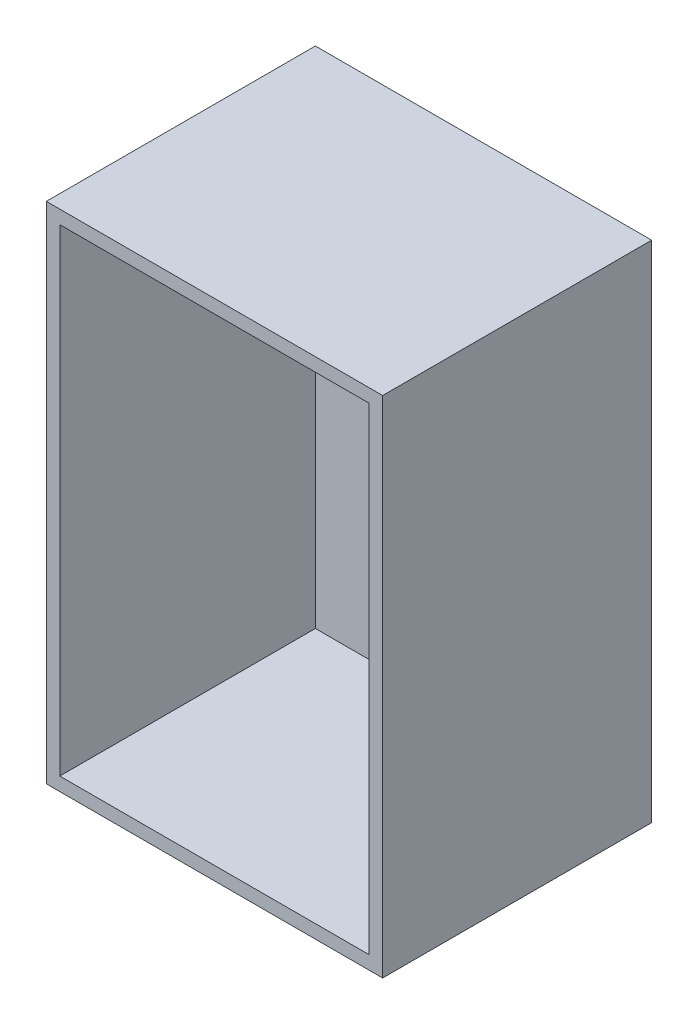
ISO-10303-21;
HEADER;
FILE_DESCRIPTION(('STEP AP214'),'2;1');
FILE_NAME('part.step','',(''),(''),'','','');
FILE_SCHEMA(('AUTOMOTIVE_DESIGN { 1 0 10303 214 1 1 1 1 }'));
ENDSEC;
DATA;
#1=APPLICATION_CONTEXT('core data for automotive mechanical design processes');
#2=APPLICATION_PROTOCOL_DEFINITION('international standard','automotive_design',2000,#1);
#3=PRODUCT_CONTEXT('',#1,'mechanical');
#4=PRODUCT('Part','Part','',(#3));
#5=PRODUCT_RELATED_PRODUCT_CATEGORY('part','',(#4));
#6=PRODUCT_DEFINITION_FORMATION('','',#4);
#7=PRODUCT_DEFINITION_CONTEXT('part definition',#1,'design');
#8=PRODUCT_DEFINITION('design','',#6,#7);
#9=PRODUCT_DEFINITION_SHAPE('','',#8);
#10=(LENGTH_UNIT() NAMED_UNIT(*) SI_UNIT(.MILLI.,.METRE.));
#11=(NAMED_UNIT(*) PLANE_ANGLE_UNIT() SI_UNIT($,.RADIAN.));
#12=(NAMED_UNIT(*) SI_UNIT($,.STERADIAN.) SOLID_ANGLE_UNIT());
#13=UNCERTAINTY_MEASURE_WITH_UNIT(LENGTH_MEASURE(1.E-05),#10,'distance_accuracy_value','');
#14=(GEOMETRIC_REPRESENTATION_CONTEXT(3) GLOBAL_UNCERTAINTY_ASSIGNED_CONTEXT((#13)) GLOBAL_UNIT_ASSIGNED_CONTEXT((#10,
#11,#12)) REPRESENTATION_CONTEXT('',''));
#15=CARTESIAN_POINT('',(0.,0.,0.));
#16=DIRECTION('',(0.,0.,1.));
#17=DIRECTION('',(1.,0.,0.));
#18=AXIS2_PLACEMENT_3D('',#15,#16,#17);
#19=CARTESIAN_POINT('',(-50.,-75.,40.));
#20=DIRECTION('',(1.,0.,0.));
#21=DIRECTION('',(0.,0.,-1.));
#22=AXIS2_PLACEMENT_3D('',#19,#20,#21);
#23=PLANE('',#22);
#24=DIRECTION('',(0.,-1.,0.));
#25=VECTOR('',#24,1.);
#26=CARTESIAN_POINT('',(-50.,-75.,-40.));
#27=LINE('',#26,#25);
#28=CARTESIAN_POINT('',(-50.,75.,-40.));
#29=VERTEX_POINT('',#28);
#30=CARTESIAN_POINT('',(-50.,-75.,-40.));
#31=VERTEX_POINT('',#30);
#32=EDGE_CURVE('E146',#29,#31,#27,.T.);
#33=ORIENTED_EDGE('',*,*,#32,.T.);
#34=DIRECTION('',(0.,0.,-1.));
#35=VECTOR('',#34,1.);
#36=CARTESIAN_POINT('',(-50.,-75.,40.));
#37=LINE('',#36,#35);
#38=CARTESIAN_POINT('',(-50.,-75.,40.));
#39=VERTEX_POINT('',#38);
#40=EDGE_CURVE('E11',#39,#31,#37,.T.);
#41=ORIENTED_EDGE('',*,*,#40,.F.);
#42=DIRECTION('',(0.,-1.,0.));
#43=VECTOR('',#42,1.);
#44=CARTESIAN_POINT('',(-50.,-75.,40.));
#45=LINE('',#44,#43);
#46=CARTESIAN_POINT('',(-50.,75.,40.));
#47=VERTEX_POINT('',#46);
#48=EDGE_CURVE('E139',#47,#39,#45,.T.);
#49=ORIENTED_EDGE('',*,*,#48,.F.);
#50=DIRECTION('',(0.,0.,-1.));
#51=VECTOR('',#50,1.);
#52=CARTESIAN_POINT('',(-50.,75.,40.));
#53=LINE('',#52,#51);
#54=EDGE_CURVE('E145',#47,#29,#53,.T.);
#55=ORIENTED_EDGE('',*,*,#54,.T.);
#56=EDGE_LOOP('',(#33,#41,#49,#55));
#57=FACE_BOUND('',#56,.T.);
#58=ADVANCED_FACE('F32',(#57),#23,.F.);
#59=CARTESIAN_POINT('',(50.,-75.,40.));
#60=DIRECTION('',(0.,1.,0.));
#61=DIRECTION('',(-1.,0.,0.));
#62=AXIS2_PLACEMENT_3D('',#59,#60,#61);
#63=PLANE('',#62);
#64=DIRECTION('',(1.,0.,0.));
#65=VECTOR('',#64,1.);
#66=CARTESIAN_POINT('',(50.,-75.,-40.));
#67=LINE('',#66,#65);
#68=CARTESIAN_POINT('',(50.,-75.,-40.));
#69=VERTEX_POINT('',#68);
#70=EDGE_CURVE('E149',#31,#69,#67,.T.);
#71=ORIENTED_EDGE('',*,*,#70,.T.);
#72=DIRECTION('',(0.,0.,-1.));
#73=VECTOR('',#72,1.);
#74=CARTESIAN_POINT('',(50.,-75.,40.));
#75=LINE('',#74,#73);
#76=CARTESIAN_POINT('',(50.,-75.,40.));
#77=VERTEX_POINT('',#76);
#78=EDGE_CURVE('E39',#77,#69,#75,.T.);
#79=ORIENTED_EDGE('',*,*,#78,.F.);
#80=DIRECTION('',(1.,0.,0.));
#81=VECTOR('',#80,1.);
#82=CARTESIAN_POINT('',(50.,-75.,40.));
#83=LINE('',#82,#81);
#84=EDGE_CURVE('E83',#39,#77,#83,.T.);
#85=ORIENTED_EDGE('',*,*,#84,.F.);
#86=ORIENTED_EDGE('',*,*,#40,.T.);
#87=EDGE_LOOP('',(#71,#79,#85,#86));
#88=FACE_BOUND('',#87,.T.);
#89=ADVANCED_FACE('F178',(#88),#63,.F.);
#90=CARTESIAN_POINT('',(50.,-75.,40.));
#91=DIRECTION('',(-1.,0.,0.));
#92=DIRECTION('',(0.,0.,1.));
#93=AXIS2_PLACEMENT_3D('',#90,#91,#92);
#94=PLANE('',#93);
#95=DIRECTION('',(0.,1.,0.));
#96=VECTOR('',#95,1.);
#97=CARTESIAN_POINT('',(50.,-75.,-40.));
#98=LINE('',#97,#96);
#99=CARTESIAN_POINT('',(50.,75.,-40.));
#100=VERTEX_POINT('',#99);
#101=EDGE_CURVE('E151',#69,#100,#98,.T.);
#102=ORIENTED_EDGE('',*,*,#101,.T.);
#103=DIRECTION('',(0.,0.,-1.));
#104=VECTOR('',#103,1.);
#105=CARTESIAN_POINT('',(50.,75.,40.));
#106=LINE('',#105,#104);
#107=CARTESIAN_POINT('',(50.,75.,40.));
#108=VERTEX_POINT('',#107);
#109=EDGE_CURVE('E155',#108,#100,#106,.T.);
#110=ORIENTED_EDGE('',*,*,#109,.F.);
#111=DIRECTION('',(0.,1.,0.));
#112=VECTOR('',#111,1.);
#113=CARTESIAN_POINT('',(50.,-75.,40.));
#114=LINE('',#113,#112);
#115=EDGE_CURVE('E142',#77,#108,#114,.T.);
#116=ORIENTED_EDGE('',*,*,#115,.F.);
#117=ORIENTED_EDGE('',*,*,#78,.T.);
#118=EDGE_LOOP('',(#102,#110,#116,#117));
#119=FACE_BOUND('',#118,.T.);
#120=ADVANCED_FACE('F160',(#119),#94,.F.);
#121=CARTESIAN_POINT('',(50.,75.,40.));
#122=DIRECTION('',(0.,-1.,0.));
#123=DIRECTION('',(1.,0.,0.));
#124=AXIS2_PLACEMENT_3D('',#121,#122,#123);
#125=PLANE('',#124);
#126=DIRECTION('',(-1.,0.,0.));
#127=VECTOR('',#126,1.);
#128=CARTESIAN_POINT('',(50.,75.,-40.));
#129=LINE('',#128,#127);
#130=EDGE_CURVE('E76',#100,#29,#129,.T.);
#131=ORIENTED_EDGE('',*,*,#130,.T.);
#132=ORIENTED_EDGE('',*,*,#54,.F.);
#133=DIRECTION('',(-1.,0.,0.));
#134=VECTOR('',#133,1.);
#135=CARTESIAN_POINT('',(50.,75.,40.));
#136=LINE('',#135,#134);
#137=EDGE_CURVE('E55',#108,#47,#136,.T.);
#138=ORIENTED_EDGE('',*,*,#137,.F.);
#139=ORIENTED_EDGE('',*,*,#109,.T.);
#140=EDGE_LOOP('',(#131,#132,#138,#139));
#141=FACE_BOUND('',#140,.T.);
#142=ADVANCED_FACE('F168',(#141),#125,.F.);
#143=CARTESIAN_POINT('',(0.,0.,40.));
#144=DIRECTION('',(0.,0.,1.));
#145=DIRECTION('',(1.,0.,0.));
#146=AXIS2_PLACEMENT_3D('',#143,#144,#145);
#147=PLANE('',#146);
#148=DIRECTION('',(0.,-1.,0.));
#149=VECTOR('',#148,1.);
#150=CARTESIAN_POINT('',(-46.,-75.,40.));
#151=LINE('',#150,#149);
#152=CARTESIAN_POINT('',(-46.,71.,40.));
#153=VERTEX_POINT('',#152);
#154=CARTESIAN_POINT('',(-46.,-71.,40.));
#155=VERTEX_POINT('',#154);
#156=EDGE_CURVE('E128',#153,#155,#151,.T.);
#157=ORIENTED_EDGE('',*,*,#156,.F.);
#158=DIRECTION('',(-1.,0.,0.));
#159=VECTOR('',#158,1.);
#160=CARTESIAN_POINT('',(50.,71.,40.));
#161=LINE('',#160,#159);
#162=CARTESIAN_POINT('',(46.,71.,40.));
#163=VERTEX_POINT('',#162);
#164=EDGE_CURVE('E137',#163,#153,#161,.T.);
#165=ORIENTED_EDGE('',*,*,#164,.F.);
#166=DIRECTION('',(0.,1.,0.));
#167=VECTOR('',#166,1.);
#168=CARTESIAN_POINT('',(46.,-75.,40.));
#169=LINE('',#168,#167);
#170=CARTESIAN_POINT('',(46.,-71.,40.));
#171=VERTEX_POINT('',#170);
#172=EDGE_CURVE('E135',#171,#163,#169,.T.);
#173=ORIENTED_EDGE('',*,*,#172,.F.);
#174=DIRECTION('',(1.,0.,0.));
#175=VECTOR('',#174,1.);
#176=CARTESIAN_POINT('',(50.,-71.,40.));
#177=LINE('',#176,#175);
#178=EDGE_CURVE('E120',#155,#171,#177,.T.);
#179=ORIENTED_EDGE('',*,*,#178,.F.);
#180=EDGE_LOOP('',(#157,#165,#173,#179));
#181=FACE_BOUND('',#180,.T.);
#182=ORIENTED_EDGE('',*,*,#48,.T.);
#183=ORIENTED_EDGE('',*,*,#84,.T.);
#184=ORIENTED_EDGE('',*,*,#115,.T.);
#185=ORIENTED_EDGE('',*,*,#137,.T.);
#186=EDGE_LOOP('',(#182,#183,#184,#185));
#187=FACE_BOUND('',#186,.T.);
#188=ADVANCED_FACE('F170',(#181,#187),#147,.T.);
#189=CARTESIAN_POINT('',(0.,0.,-40.));
#190=DIRECTION('',(0.,0.,1.));
#191=DIRECTION('',(1.,0.,0.));
#192=AXIS2_PLACEMENT_3D('',#189,#190,#191);
#193=PLANE('',#192);
#194=ORIENTED_EDGE('',*,*,#32,.F.);
#195=ORIENTED_EDGE('',*,*,#130,.F.);
#196=ORIENTED_EDGE('',*,*,#101,.F.);
#197=ORIENTED_EDGE('',*,*,#70,.F.);
#198=EDGE_LOOP('',(#194,#195,#196,#197));
#199=FACE_BOUND('',#198,.T.);
#200=ADVANCED_FACE('F164',(#199),#193,.F.);
#201=CARTESIAN_POINT('',(-46.,-75.,40.));
#202=DIRECTION('',(1.,0.,0.));
#203=DIRECTION('',(0.,0.,-1.));
#204=AXIS2_PLACEMENT_3D('',#201,#202,#203);
#205=PLANE('',#204);
#206=DIRECTION('',(0.,-1.,0.));
#207=VECTOR('',#206,1.);
#208=CARTESIAN_POINT('',(-46.,-75.,-36.));
#209=LINE('',#208,#207);
#210=CARTESIAN_POINT('',(-46.,71.,-36.));
#211=VERTEX_POINT('',#210);
#212=CARTESIAN_POINT('',(-46.,-71.,-36.));
#213=VERTEX_POINT('',#212);
#214=EDGE_CURVE('E111',#211,#213,#209,.T.);
#215=ORIENTED_EDGE('',*,*,#214,.F.);
#216=DIRECTION('',(0.,0.,-1.));
#217=VECTOR('',#216,1.);
#218=CARTESIAN_POINT('',(-46.,71.,40.));
#219=LINE('',#218,#217);
#220=EDGE_CURVE('E131',#153,#211,#219,.T.);
#221=ORIENTED_EDGE('',*,*,#220,.F.);
#222=ORIENTED_EDGE('',*,*,#156,.T.);
#223=DIRECTION('',(0.,0.,-1.));
#224=VECTOR('',#223,1.);
#225=CARTESIAN_POINT('',(-46.,-71.,40.));
#226=LINE('',#225,#224);
#227=EDGE_CURVE('E123',#155,#213,#226,.T.);
#228=ORIENTED_EDGE('',*,*,#227,.T.);
#229=EDGE_LOOP('',(#215,#221,#222,#228));
#230=FACE_BOUND('',#229,.T.);
#231=ADVANCED_FACE('F205',(#230),#205,.T.);
#232=CARTESIAN_POINT('',(50.,-71.,40.));
#233=DIRECTION('',(0.,1.,0.));
#234=DIRECTION('',(-1.,0.,0.));
#235=AXIS2_PLACEMENT_3D('',#232,#233,#234);
#236=PLANE('',#235);
#237=DIRECTION('',(1.,0.,0.));
#238=VECTOR('',#237,1.);
#239=CARTESIAN_POINT('',(50.,-71.,-36.));
#240=LINE('',#239,#238);
#241=CARTESIAN_POINT('',(46.,-71.,-36.));
#242=VERTEX_POINT('',#241);
#243=EDGE_CURVE('E105',#213,#242,#240,.T.);
#244=ORIENTED_EDGE('',*,*,#243,.F.);
#245=ORIENTED_EDGE('',*,*,#227,.F.);
#246=ORIENTED_EDGE('',*,*,#178,.T.);
#247=DIRECTION('',(0.,0.,-1.));
#248=VECTOR('',#247,1.);
#249=CARTESIAN_POINT('',(46.,-71.,40.));
#250=LINE('',#249,#248);
#251=EDGE_CURVE('E117',#171,#242,#250,.T.);
#252=ORIENTED_EDGE('',*,*,#251,.T.);
#253=EDGE_LOOP('',(#244,#245,#246,#252));
#254=FACE_BOUND('',#253,.T.);
#255=ADVANCED_FACE('F118',(#254),#236,.T.);
#256=CARTESIAN_POINT('',(46.,-75.,40.));
#257=DIRECTION('',(-1.,0.,0.));
#258=DIRECTION('',(0.,0.,1.));
#259=AXIS2_PLACEMENT_3D('',#256,#257,#258);
#260=PLANE('',#259);
#261=DIRECTION('',(0.,1.,0.));
#262=VECTOR('',#261,1.);
#263=CARTESIAN_POINT('',(46.,-75.,-36.));
#264=LINE('',#263,#262);
#265=CARTESIAN_POINT('',(46.,71.,-36.));
#266=VERTEX_POINT('',#265);
#267=EDGE_CURVE('E109',#242,#266,#264,.T.);
#268=ORIENTED_EDGE('',*,*,#267,.F.);
#269=ORIENTED_EDGE('',*,*,#251,.F.);
#270=ORIENTED_EDGE('',*,*,#172,.T.);
#271=DIRECTION('',(0.,0.,-1.));
#272=VECTOR('',#271,1.);
#273=CARTESIAN_POINT('',(46.,71.,40.));
#274=LINE('',#273,#272);
#275=EDGE_CURVE('E46',#163,#266,#274,.T.);
#276=ORIENTED_EDGE('',*,*,#275,.T.);
#277=EDGE_LOOP('',(#268,#269,#270,#276));
#278=FACE_BOUND('',#277,.T.);
#279=ADVANCED_FACE('F125',(#278),#260,.T.);
#280=CARTESIAN_POINT('',(50.,71.,40.));
#281=DIRECTION('',(0.,-1.,0.));
#282=DIRECTION('',(1.,0.,0.));
#283=AXIS2_PLACEMENT_3D('',#280,#281,#282);
#284=PLANE('',#283);
#285=DIRECTION('',(-1.,0.,0.));
#286=VECTOR('',#285,1.);
#287=CARTESIAN_POINT('',(50.,71.,-36.));
#288=LINE('',#287,#286);
#289=EDGE_CURVE('E126',#266,#211,#288,.T.);
#290=ORIENTED_EDGE('',*,*,#289,.F.);
#291=ORIENTED_EDGE('',*,*,#275,.F.);
#292=ORIENTED_EDGE('',*,*,#164,.T.);
#293=ORIENTED_EDGE('',*,*,#220,.T.);
#294=EDGE_LOOP('',(#290,#291,#292,#293));
#295=FACE_BOUND('',#294,.T.);
#296=ADVANCED_FACE('F235',(#295),#284,.T.);
#297=CARTESIAN_POINT('',(0.,0.,-36.));
#298=DIRECTION('',(0.,0.,1.));
#299=DIRECTION('',(1.,0.,0.));
#300=AXIS2_PLACEMENT_3D('',#297,#298,#299);
#301=PLANE('',#300);
#302=ORIENTED_EDGE('',*,*,#214,.T.);
#303=ORIENTED_EDGE('',*,*,#243,.T.);
#304=ORIENTED_EDGE('',*,*,#267,.T.);
#305=ORIENTED_EDGE('',*,*,#289,.T.);
#306=EDGE_LOOP('',(#302,#303,#304,#305));
#307=FACE_BOUND('',#306,.T.);
#308=ADVANCED_FACE('F107',(#307),#301,.T.);
#309=CLOSED_SHELL('',(#58,#89,#120,#142,#188,#200,#231,#255,#279,#296,#308));
#310=MANIFOLD_SOLID_BREP('B2',#309);
#311=ADVANCED_BREP_SHAPE_REPRESENTATION('',(#18,#310),#14);
#312=SHAPE_DEFINITION_REPRESENTATION(#9,#311);
ENDSEC;
END-ISO-10303-21;
